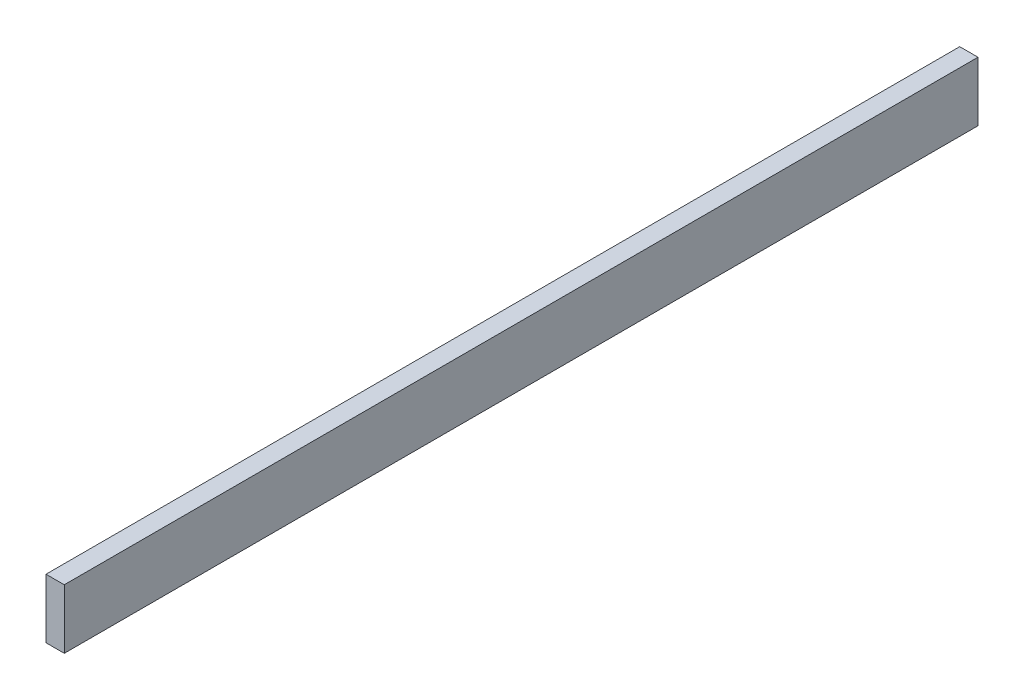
from build123d import *

# Parameters (mm, degrees)
ESQUISSE1_W      = 4
ESQUISSE1_H      = 13
EXTRUSION1_DEPTH = 100


with BuildPart() as part:
    # Esquisse1 → Extrusion1 (new, symmetric)
    with BuildSketch(Plane.XY):
        Rectangle(ESQUISSE1_W, ESQUISSE1_H)
    extrude(amount=EXTRUSION1_DEPTH, both=True)


solid = part.part
